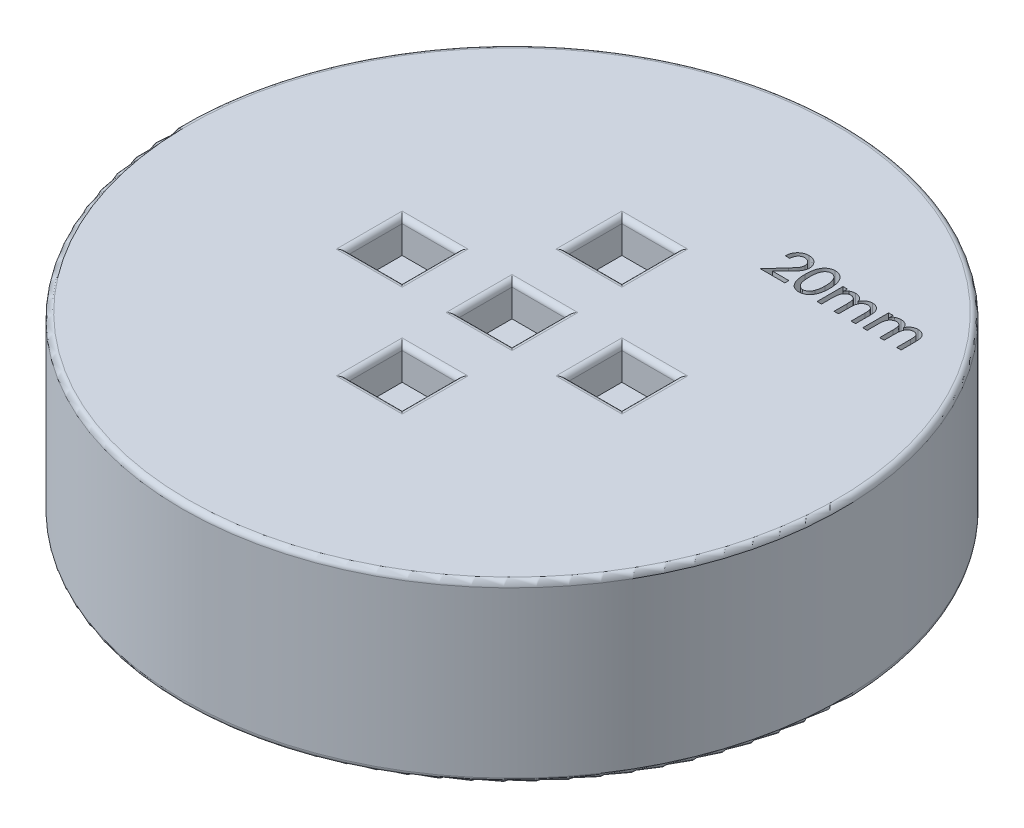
from build123d import *

# Parameters (mm, degrees)
SKETCH1_R           = 30
BOSS_EXTRUDE1_DEPTH = 16
SKETCH2_W           = 5
SKETCH2_H           = 5
CUT_EXTRUDE1_DEPTH  = 3
FILLET1_R           = 0.5
SKETCH4_W           = 5
SKETCH4_H           = 5
CUT_EXTRUDE2_DEPTH  = 3
FILLET2_R           = 0.5
FILLET3_R           = 0.5
CUT_EXTRUDE3_DEPTH  = 2


with BuildPart() as part:
    # Sketch1 → Boss-Extrude1 (new body)
    with BuildSketch(Plane(origin=(0, 0, 0), x_dir=(1, 0, 0), z_dir=(0, 1, 0))):
        with Locations(Location((0, 0, 0), (0, 0, 270))):
            Circle(SKETCH1_R)
    extrude(amount=BOSS_EXTRUDE1_DEPTH)

    # Sketch2 → Cut-Extrude1 (cut)
    with BuildSketch(Plane(origin=(0, 16, 0), x_dir=(1, 0, 0), z_dir=(0, 1, 0))):
        with Locations((0, -10)):
            Rectangle(SKETCH2_W, SKETCH2_H)
        with Locations((-10, 0)):
            Rectangle(SKETCH2_W, SKETCH2_H)
        Rectangle(SKETCH2_W, SKETCH2_H)
        with Locations((0, 10)):
            Rectangle(SKETCH2_W, SKETCH2_H)
        with Locations((10, 0)):
            Rectangle(SKETCH2_W, SKETCH2_H)
    extrude(amount=-CUT_EXTRUDE1_DEPTH, mode=Mode.SUBTRACT)

    # Fillet1
    fillet1_edges = [part.edges().sort_by_distance(p)[0] for p in [
        (2.5, 16, 0),
        (0, 16, 2.5),
        (-12.5, 16, 0),
        (-10, 16, 2.5),
        (-7.5, 16, 0),
        (-10, 16, -2.5),
    ]]
    fillet(fillet1_edges, radius=FILLET1_R)

    # Sketch4 → Cut-Extrude2 (cut)
    with BuildSketch(Plane(origin=(0, 0, 0), x_dir=(-1, 0, 0), z_dir=(0, -1, 0))):
        Rectangle(SKETCH4_W, SKETCH4_H)
        with Locations((0, -10)):
            Rectangle(SKETCH4_W, SKETCH4_H)
        with Locations((10, 0)):
            Rectangle(SKETCH4_W, SKETCH4_H)
        with Locations((-10, 0)):
            Rectangle(SKETCH4_W, SKETCH4_H)
        with Locations((0, 10)):
            Rectangle(SKETCH4_W, SKETCH4_H)
    extrude(amount=-CUT_EXTRUDE2_DEPTH, mode=Mode.SUBTRACT)

    # Fillet2
    fillet2_edges = [part.edges().sort_by_distance(p)[0] for p in [
        (-2.5, 0, 0),
        (0, 0, -2.5),
        (2.5, 0, 0),
        (0, 0, 2.5),
        (-2.5, 0, 10),
        (0, 0, 7.5),
        (2.5, 0, 10),
        (0, 0, 12.5),
        (-12.5, 0, 0),
        (-10, 0, -2.5),
        (-7.5, 0, 0),
        (-10, 0, 2.5),
        (7.5, 0, 0),
        (10, 0, -2.5),
        (12.5, 0, 0),
        (10, 0, 2.5),
        (2.5, 0, -10),
        (0, 0, -7.5),
        (-2.5, 0, -10),
        (0, 0, -12.5),
        (0, 0, -30),
    ]]
    fillet(fillet2_edges, radius=FILLET2_R)

    # Fillet3
    fillet3_edges = [part.edges().sort_by_distance(p)[0] for p in [
        (0, 16, -30),
        (0, 16, 7.5),
        (-2.5, 16, 10),
        (0, 16, 12.5),
        (2.5, 16, 10),
        (-2.5, 16, 0.25),
        (0.25, 16, -2.5),
        (0, 16, -12.5),
        (-2.5, 16, -10),
        (0, 16, -7.5),
        (2.5, 16, -10),
        (10, 16, 2.5),
        (12.5, 16, 0),
        (10, 16, -2.5),
        (7.5, 16, 0),
    ]]
    fillet(fillet3_edges, radius=FILLET3_R)

    # Sketch5 → Cut-Extrude3 (cut)
    # profile 1 of 4: a face of its own
    with BuildSketch(Plane(origin=(0, 16, 0), x_dir=(1, 0, 0), z_dir=(0, 1, 0))):
        with BuildLine():
            Line((8.369706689, 16.912131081), (7.967107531, 16.912131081))
            add(Edge.make_bspline(
                [(7.967107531, 16.912131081), (7.96899866, 16.953097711), (7.97269745, 17.033222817), (7.989121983, 17.149974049), (8.015728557, 17.259983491), (8.04931167, 17.36418373), (8.094110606, 17.461272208), (8.145799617, 17.552941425), (8.20820013, 17.637270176), (8.278716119, 17.71439186), (8.355263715, 17.784459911), (8.43755274, 17.844878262), (8.524192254, 17.896363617), (8.615199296, 17.938376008), (8.710752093, 17.970905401), (8.810578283, 17.994576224), (8.914996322, 18.008813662), (8.986175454, 18.01037699), (9.022260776, 18.011169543)],
                knots=[0, 0, 0, 0, 1.154964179, 2.258951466, 3.315045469, 4.34063582, 5.337653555, 6.322213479, 7.300594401, 8.285733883, 9.262436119, 10.219305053, 11.156568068, 12.097250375, 13.037875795, 13.995471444, 14.983774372, 16, 16, 16, 16], degree=3))
            add(Edge.make_bspline(
                [(9.022260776, 18.011169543), (9.060042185, 18.010396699), (9.134179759, 18.008880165), (9.242141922, 17.994609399), (9.344318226, 17.971597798), (9.44073859, 17.940172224), (9.531227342, 17.898210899), (9.61596292, 17.847610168), (9.694130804, 17.786789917), (9.766298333, 17.718735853), (9.830040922, 17.643875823), (9.887613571, 17.566910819), (9.93520294, 17.486279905), (9.975070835, 17.403455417), (10.005749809, 17.317757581), (10.027415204, 17.229535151), (10.040401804, 17.138728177), (10.042174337, 17.077325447), (10.043069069, 17.046330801)],
                knots=[0, 0, 0, 0, 1.156722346, 2.269809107, 3.328396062, 4.361258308, 5.3694338, 6.377253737, 7.377324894, 8.397019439, 9.4098266, 10.385180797, 11.337325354, 12.27255833, 13.196816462, 14.119704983, 15.050871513, 16, 16, 16, 16], degree=3))
            add(Edge.make_bspline(
                [(10.043069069, 17.046330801), (10.041440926, 17.002974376), (10.038206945, 16.916855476), (10.013304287, 16.789447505), (9.971440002, 16.666143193), (9.923082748, 16.565741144), (9.874175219, 16.484584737), (9.829293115, 16.417597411), (9.776568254, 16.345163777), (9.714869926, 16.26776871), (9.646651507, 16.183641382), (9.569203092, 16.094952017), (9.484921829, 15.999905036), (9.424813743, 15.935904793), (9.393695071, 15.902771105)],
                knots=[0, 0, 0, 0, 1.155755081, 2.295677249, 3.447123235, 4.6205014, 5.259503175, 5.973005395, 6.77029923, 7.648035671, 8.612336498, 9.658570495, 10.787814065, 12, 12, 12, 12], degree=3))
            Line((9.393695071, 15.902771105), (8.612665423, 15.12110544))
            Line((8.612665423, 15.12110544), (10.083774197, 15.12110544))
            Line((10.083774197, 15.12110544), (10.083774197, 14.754759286))
            Line((10.083774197, 14.754759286), (7.844992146, 14.754759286))
            Line((7.844992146, 14.754759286), (9.059785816, 16.096120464))
            add(Edge.make_bspline(
                [(9.059785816, 16.096120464), (9.088720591, 16.126979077), (9.144246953, 16.18619732), (9.222503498, 16.272883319), (9.293108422, 16.353023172), (9.356438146, 16.426559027), (9.410834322, 16.494479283), (9.457760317, 16.555784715), (9.496684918, 16.610764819), (9.537108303, 16.675480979), (9.57716373, 16.753058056), (9.611238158, 16.847691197), (9.631684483, 16.944332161), (9.634572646, 17.009347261), (9.636017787, 17.041878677)],
                knots=[0, 0, 0, 0, 1.341560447, 2.574479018, 3.703506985, 4.728875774, 5.651874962, 6.462761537, 7.177175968, 7.787249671, 8.88179658, 9.938774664, 10.968630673, 12, 12, 12, 12], degree=3))
            add(Edge.make_bspline(
                [(9.636017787, 17.041878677), (9.635661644, 17.062059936), (9.634956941, 17.101992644), (9.625349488, 17.160469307), (9.611815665, 17.217188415), (9.590883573, 17.271238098), (9.565664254, 17.323681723), (9.534119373, 17.373841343), (9.49623958, 17.421251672), (9.454101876, 17.466979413), (9.407496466, 17.508266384), (9.358270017, 17.545294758), (9.30581716, 17.575366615), (9.251572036, 17.60166498), (9.193848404, 17.620308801), (9.134065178, 17.634190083), (9.07175294, 17.643805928), (9.02929402, 17.644479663), (9.00763237, 17.644823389)],
                knots=[0, 0, 0, 0, 0.999432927, 1.977580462, 2.931018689, 3.885672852, 4.844657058, 5.812871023, 6.815890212, 7.849665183, 8.891901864, 9.898878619, 10.897592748, 11.885014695, 12.882178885, 13.896915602, 14.927050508, 16, 16, 16, 16], degree=3))
            add(Edge.make_bspline(
                [(9.00763237, 17.644823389), (8.98703875, 17.64440101), (8.946525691, 17.643570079), (8.886860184, 17.634996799), (8.829588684, 17.621037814), (8.77451799, 17.601675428), (8.721249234, 17.577787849), (8.671084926, 17.546841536), (8.623205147, 17.510841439), (8.576976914, 17.47043675), (8.53490389, 17.423034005), (8.497272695, 17.369194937), (8.464042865, 17.308860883), (8.435639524, 17.242137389), (8.412100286, 17.168849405), (8.393217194, 17.089086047), (8.378618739, 17.002812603), (8.372732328, 16.942917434), (8.369706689, 16.912131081)],
                knots=[0, 0, 0, 0, 0.911540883, 1.79324023, 2.663162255, 3.518366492, 4.375475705, 5.243419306, 6.122264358, 7.02676621, 7.957780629, 8.921596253, 9.930241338, 11.002848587, 12.128200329, 13.335197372, 14.630280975, 16, 16, 16, 16], degree=3))
        make_face()
    # profile 2 of 4: a face of its own
    with BuildSketch(Plane(origin=(0, 16, 0), x_dir=(1, 0, 0), z_dir=(0, 1, 0))):
        with BuildLine():
            add(Edge.make_bspline(
                [(10.328004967, 16.340987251), (10.328308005, 16.391450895), (10.328896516, 16.489453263), (10.33523799, 16.632021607), (10.3461775, 16.765843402), (10.360228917, 16.890922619), (10.37966868, 17.007345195), (10.401911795, 17.115168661), (10.429292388, 17.214406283), (10.461273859, 17.30523514), (10.49718262, 17.389268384), (10.536664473, 17.467558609), (10.57946936, 17.541099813), (10.625308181, 17.60986638), (10.676348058, 17.67232629), (10.729592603, 17.730618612), (10.787041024, 17.783605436), (10.848166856, 17.831021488), (10.911398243, 17.873890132), (10.977482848, 17.910022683), (11.044889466, 17.941497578), (11.114477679, 17.966958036), (11.185742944, 17.986735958), (11.258940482, 18.000547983), (11.333722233, 18.010059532), (11.38440043, 18.010798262), (11.409870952, 18.011169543)],
                knots=[0, 0, 0, 0, 1.622528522, 3.151013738, 4.587225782, 5.939257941, 7.196658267, 8.381214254, 9.47772444, 10.503964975, 11.475138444, 12.414102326, 13.321377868, 14.209997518, 15.068075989, 15.912287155, 16.746865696, 17.577313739, 18.397854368, 19.200328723, 19.996378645, 20.787862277, 21.580050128, 22.371504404, 23.181529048, 24, 24, 24, 24], degree=3))
            add(Edge.make_bspline(
                [(11.409870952, 18.011169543), (11.43765651, 18.010437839), (11.492500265, 18.008993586), (11.573891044, 18.001133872), (11.652552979, 17.985254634), (11.72956535, 17.965341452), (11.803680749, 17.938119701), (11.876367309, 17.906815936), (11.94538778, 17.867166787), (12.013096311, 17.823796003), (12.077171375, 17.773780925), (12.138456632, 17.719436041), (12.195041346, 17.658906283), (12.248988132, 17.594274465), (12.297529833, 17.523009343), (12.343740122, 17.447606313), (12.384656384, 17.366187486), (12.423476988, 17.280193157), (12.456845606, 17.187336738), (12.487047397, 17.088148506), (12.511522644, 16.981392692), (12.531825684, 16.867401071), (12.547472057, 16.745981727), (12.559027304, 16.61742308), (12.565060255, 16.481604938), (12.56620119, 16.388693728), (12.566787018, 16.340987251)],
                knots=[0, 0, 0, 0, 0.875057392, 1.727207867, 2.570264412, 3.399251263, 4.229017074, 5.053828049, 5.887584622, 6.731829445, 7.583639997, 8.443960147, 9.308026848, 10.190032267, 11.091770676, 12.020167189, 12.972467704, 13.958579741, 14.989078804, 16.076606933, 17.221320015, 18.435081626, 19.720875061, 21.074561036, 22.497895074, 24, 24, 24, 24], degree=3))
            add(Edge.make_bspline(
                [(12.566787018, 16.340987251), (12.566195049, 16.293493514), (12.565042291, 16.201007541), (12.559095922, 16.065814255), (12.547241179, 15.937954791), (12.532644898, 15.817070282), (12.512171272, 15.703527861), (12.487242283, 15.597267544), (12.459286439, 15.497730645), (12.425111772, 15.405789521), (12.387270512, 15.319896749), (12.346215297, 15.239205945), (12.300999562, 15.163558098), (12.250934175, 15.093773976), (12.198404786, 15.027657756), (12.141129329, 14.967507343), (12.080151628, 14.912176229), (12.015619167, 14.862369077), (11.948270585, 14.817453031), (11.87768339, 14.77953846), (11.805636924, 14.745885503), (11.73052258, 14.720381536), (11.653863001, 14.698615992), (11.574367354, 14.684556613), (11.492773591, 14.675248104), (11.437670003, 14.673985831), (11.409870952, 14.67334903)],
                knots=[0, 0, 0, 0, 1.496607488, 2.914388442, 4.262485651, 5.541812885, 6.749953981, 7.895567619, 8.980172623, 10.005210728, 10.983286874, 11.936336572, 12.856292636, 13.757107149, 14.640766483, 15.514956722, 16.370989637, 17.232841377, 18.081413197, 18.918442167, 19.755471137, 20.583656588, 21.41504191, 22.264086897, 23.124254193, 24, 24, 24, 24], degree=3))
            add(Edge.make_bspline(
                [(11.409870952, 14.67334903), (11.384196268, 14.673785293), (11.333345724, 14.674649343), (11.258256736, 14.683123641), (11.185109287, 14.697188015), (11.114118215, 14.716899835), (11.044784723, 14.741926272), (10.977409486, 14.772242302), (10.912435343, 14.808951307), (10.849242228, 14.850196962), (10.788747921, 14.897110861), (10.732401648, 14.95013531), (10.678848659, 15.0080031), (10.629149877, 15.071338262), (10.582207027, 15.13973194), (10.539888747, 15.21382849), (10.500434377, 15.292836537), (10.463855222, 15.377364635), (10.430827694, 15.468881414), (10.404485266, 15.56917732), (10.379644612, 15.677157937), (10.361415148, 15.793915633), (10.345598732, 15.918569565), (10.336422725, 16.051928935), (10.32858112, 16.193551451), (10.328200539, 16.290940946), (10.328004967, 16.340987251)],
                knots=[0, 0, 0, 0, 0.82614074, 1.636230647, 2.42850654, 3.22151677, 4.005075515, 4.799112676, 5.596456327, 6.404618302, 7.226350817, 8.05679228, 8.892237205, 9.761873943, 10.645770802, 11.559890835, 12.505927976, 13.487073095, 14.523090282, 15.633895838, 16.822583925, 18.088023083, 19.435493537, 20.865857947, 22.389433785, 24, 24, 24, 24], degree=3))
        make_face()
        with BuildLine():
            add(Edge.make_bspline(
                [(10.735056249, 16.342259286), (10.735219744, 16.299641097), (10.735536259, 16.21713547), (10.740236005, 16.097746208), (10.746927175, 15.98657616), (10.756936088, 15.883655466), (10.770282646, 15.78883109), (10.78607962, 15.702233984), (10.804090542, 15.623698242), (10.826048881, 15.553094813), (10.850362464, 15.488764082), (10.877396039, 15.429539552), (10.905465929, 15.374079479), (10.937085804, 15.323483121), (10.970572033, 15.277059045), (11.006529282, 15.234983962), (11.043673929, 15.196335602), (11.096661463, 15.153420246), (11.164554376, 15.108552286), (11.248835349, 15.069645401), (11.333751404, 15.043963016), (11.391040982, 15.041108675), (11.419411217, 15.039695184)],
                knots=[0, 0, 0, 0, 1.564601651, 3.028951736, 4.386019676, 5.653114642, 6.824348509, 7.900668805, 8.88431448, 9.780488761, 10.613163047, 11.407444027, 12.169849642, 12.89344098, 13.595615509, 14.26934431, 14.924332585, 15.560171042, 16.769153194, 17.901006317, 18.960562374, 20, 20, 20, 20], degree=3))
            add(Edge.make_bspline(
                [(11.419411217, 15.039695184), (11.451560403, 15.041377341), (11.515658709, 15.044731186), (11.610060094, 15.069151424), (11.700575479, 15.110137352), (11.772295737, 15.156442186), (11.826483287, 15.201479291), (11.86561652, 15.239819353), (11.901686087, 15.282623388), (11.935736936, 15.329239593), (11.966525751, 15.380430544), (11.996213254, 15.435034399), (12.022061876, 15.494361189), (12.037001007, 15.53570277), (12.044616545, 15.556777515)],
                knots=[0, 0, 0, 0, 1.331887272, 2.655486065, 4.012646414, 5.436183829, 6.178803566, 6.930724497, 7.703763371, 8.496530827, 9.320959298, 10.178042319, 11.071218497, 12, 12, 12, 12], degree=3))
            add(Edge.make_bspline(
                [(12.044616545, 15.556777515), (12.053791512, 15.58446674), (12.072495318, 15.640913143), (12.095928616, 15.728796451), (12.115328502, 15.821012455), (12.132032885, 15.917070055), (12.144716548, 16.017453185), (12.153483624, 16.122065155), (12.158512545, 16.230906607), (12.159323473, 16.304729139), (12.159735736, 16.342259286)],
                knots=[0, 0, 0, 0, 0.877617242, 1.789083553, 2.735016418, 3.71249782, 4.722174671, 5.778575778, 6.870664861, 8, 8, 8, 8], degree=3))
            add(Edge.make_bspline(
                [(12.159735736, 16.342259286), (12.159637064, 16.379793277), (12.159444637, 16.452990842), (12.153725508, 16.560060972), (12.146808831, 16.661977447), (12.134876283, 16.758405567), (12.121521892, 16.849826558), (12.103204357, 16.935594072), (12.08355775, 17.016564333), (12.059013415, 17.091737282), (12.032179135, 17.161871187), (12.003876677, 17.227199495), (11.973274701, 17.287774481), (11.939558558, 17.342836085), (11.903972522, 17.393292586), (11.866383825, 17.438840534), (11.826232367, 17.479223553), (11.770099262, 17.524756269), (11.697736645, 17.57214595), (11.607253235, 17.614675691), (11.513820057, 17.639748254), (11.450716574, 17.643140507), (11.419411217, 17.644823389)],
                knots=[0, 0, 0, 0, 1.353201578, 2.638969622, 3.865559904, 5.035676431, 6.141732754, 7.195734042, 8.19695873, 9.144657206, 10.044788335, 10.904062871, 11.710933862, 12.489720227, 13.229995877, 13.935715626, 14.616825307, 15.279494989, 16.538995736, 17.725922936, 18.871840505, 20, 20, 20, 20], degree=3))
            add(Edge.make_bspline(
                [(11.419411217, 17.644823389), (11.391049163, 17.643382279), (11.333571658, 17.640461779), (11.248526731, 17.615136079), (11.16454916, 17.575920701), (11.097111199, 17.531021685), (11.044561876, 17.488151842), (11.006910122, 17.450382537), (10.972124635, 17.408069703), (10.938555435, 17.36201931), (10.907903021, 17.311090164), (10.878131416, 17.256211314), (10.851900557, 17.196476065), (10.827231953, 17.132096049), (10.805504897, 17.061363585), (10.786715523, 16.982947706), (10.769924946, 16.896446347), (10.757824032, 16.801430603), (10.747651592, 16.698353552), (10.740038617, 16.587009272), (10.735593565, 16.467379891), (10.735239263, 16.384876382), (10.735056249, 16.342259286)],
                knots=[0, 0, 0, 0, 1.039778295, 2.107176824, 3.232337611, 4.43520669, 5.071253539, 5.720927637, 6.389866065, 7.081397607, 7.811854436, 8.571243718, 9.372887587, 10.205834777, 11.102302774, 12.088086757, 13.166194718, 14.33675119, 15.604261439, 16.970055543, 18.43488556, 20, 20, 20, 20], degree=3))
        make_face(mode=Mode.SUBTRACT)
    # profile 3 of 4: a face of its own
    with BuildSketch(Plane(origin=(0, 16, 0), x_dir=(1, 0, 0), z_dir=(0, 1, 0))):
        with BuildLine():
            Line((13.014543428, 17.115656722), (13.42159471, 17.115656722))
            Line((13.42159471, 17.115656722), (13.42159471, 16.71941774))
            add(Edge.make_bspline(
                [(13.42159471, 16.71941774), (13.425504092, 16.736468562), (13.433131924, 16.76973745), (13.449928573, 16.817213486), (13.470448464, 16.861114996), (13.493803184, 16.902490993), (13.522182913, 16.939736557), (13.553226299, 16.974736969), (13.589166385, 17.005146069), (13.615204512, 17.022815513), (13.628300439, 17.031702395)],
                knots=[0, 0, 0, 0, 1.08898891, 2.124791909, 3.129224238, 4.105481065, 5.077441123, 6.040388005, 7.014409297, 8, 8, 8, 8], degree=3))
            add(Edge.make_bspline(
                [(13.628300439, 17.031702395), (13.66771905, 17.051012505), (13.745549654, 17.089139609), (13.868646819, 17.127012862), (13.993186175, 17.152246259), (14.07720479, 17.154987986), (14.119306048, 17.15636185)],
                knots=[0, 0, 0, 0, 1.028471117, 2.030678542, 3.013184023, 4, 4, 4, 4], degree=3))
            add(Edge.make_bspline(
                [(14.119306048, 17.15636185), (14.150313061, 17.155572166), (14.211802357, 17.154006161), (14.302848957, 17.139406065), (14.3912745, 17.115937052), (14.476245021, 17.083546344), (14.555513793, 17.04380328), (14.627887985, 16.998895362), (14.691594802, 16.947985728), (14.747453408, 16.892243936), (14.793868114, 16.829749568), (14.830469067, 16.761317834), (14.856434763, 16.686095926), (14.865270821, 16.633306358), (14.86980685, 16.606206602)],
                knots=[0, 0, 0, 0, 1.099015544, 2.179432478, 3.260947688, 4.338981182, 5.398181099, 6.40160478, 7.353922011, 8.284349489, 9.192639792, 10.104191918, 11.026778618, 12, 12, 12, 12], degree=3))
            add(Edge.make_bspline(
                [(14.86980685, 16.606206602), (14.877153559, 16.6270907), (14.891680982, 16.668387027), (14.918246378, 16.727881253), (14.950426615, 16.783411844), (14.986818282, 16.835720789), (15.027429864, 16.885130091), (15.07370963, 16.929919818), (15.123286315, 16.972589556), (15.177957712, 17.009993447), (15.234825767, 17.044305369), (15.293503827, 17.074217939), (15.35310817, 17.099853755), (15.414119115, 17.119997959), (15.475753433, 17.136952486), (15.538963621, 17.148356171), (15.603222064, 17.154565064), (15.646372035, 17.155761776), (15.668008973, 17.15636185)],
                knots=[0, 0, 0, 0, 1.024672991, 2.026193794, 3.01103273, 3.991165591, 4.973850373, 5.96628909, 6.969107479, 7.9982829, 9.028393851, 10.042340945, 11.044967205, 12.028827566, 13.014448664, 14.002022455, 14.998142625, 16, 16, 16, 16], degree=3))
            add(Edge.make_bspline(
                [(15.668008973, 17.15636185), (15.690075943, 17.156072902), (15.733458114, 17.15550485), (15.797376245, 17.148705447), (15.859285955, 17.138795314), (15.919093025, 17.124237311), (15.976580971, 17.104900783), (16.032025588, 17.081930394), (16.085700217, 17.055462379), (16.15280677, 17.013712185), (16.231034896, 16.955453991), (16.310409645, 16.871343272), (16.37693451, 16.777624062), (16.420157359, 16.690294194), (16.447695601, 16.613657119), (16.466198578, 16.549328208), (16.481068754, 16.478476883), (16.493938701, 16.401486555), (16.503165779, 16.317807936), (16.509995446, 16.227865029), (16.514705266, 16.13136283), (16.515021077, 16.064961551), (16.515184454, 16.030610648)],
                knots=[0, 0, 0, 0, 0.823429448, 1.618806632, 2.396867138, 3.162757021, 3.913573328, 4.658737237, 5.40200746, 6.144476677, 7.607081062, 9.028926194, 10.443018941, 11.88355177, 12.649646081, 13.481287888, 14.380074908, 15.350698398, 16.394246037, 17.521443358, 18.717785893, 20, 20, 20, 20], degree=3))
            Line((16.515184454, 16.030610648), (16.515184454, 14.754759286))
            Line((16.515184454, 14.754759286), (16.108133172, 14.754759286))
            Line((16.108133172, 14.754759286), (16.108133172, 16.029338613))
            add(Edge.make_bspline(
                [(16.108133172, 16.029338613), (16.108082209, 16.057749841), (16.107984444, 16.112253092), (16.105297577, 16.190286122), (16.101523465, 16.261111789), (16.096764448, 16.324796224), (16.089731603, 16.381432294), (16.081524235, 16.431088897), (16.072572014, 16.473811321), (16.057150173, 16.52051535), (16.033054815, 16.571566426), (15.995414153, 16.62609022), (15.949148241, 16.674083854), (15.8948498, 16.715319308), (15.833917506, 16.749529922), (15.765964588, 16.77260285), (15.692874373, 16.788046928), (15.642017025, 16.789346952), (15.615855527, 16.790015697)],
                knots=[0, 0, 0, 0, 1.305376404, 2.504195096, 3.587062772, 4.564309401, 5.437885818, 6.208191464, 6.877018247, 7.440755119, 8.464755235, 9.459136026, 10.471907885, 11.51427718, 12.582498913, 13.666986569, 14.799875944, 16, 16, 16, 16], degree=3))
            add(Edge.make_bspline(
                [(15.615855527, 16.790015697), (15.58670566, 16.7885944), (15.528336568, 16.785748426), (15.442132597, 16.764914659), (15.35937561, 16.728899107), (15.279940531, 16.680882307), (15.207014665, 16.619817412), (15.142421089, 16.547233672), (15.089128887, 16.462371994), (15.051494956, 16.383496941), (15.02719936, 16.311376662), (15.011858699, 16.247436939), (14.997546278, 16.174954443), (14.987513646, 16.09328814), (14.978107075, 16.00279443), (14.97317161, 15.903233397), (14.968953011, 15.794684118), (14.968582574, 15.719391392), (14.968389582, 15.680164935)],
                knots=[0, 0, 0, 0, 0.96585306, 1.934004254, 2.919496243, 3.947541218, 5.000269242, 6.060662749, 7.154254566, 8.311133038, 8.948925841, 9.673294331, 10.489200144, 11.396606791, 12.399336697, 13.504450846, 14.699853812, 16, 16, 16, 16], degree=3))
            Line((14.968389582, 15.680164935), (14.968389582, 14.754759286))
            Line((14.968389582, 14.754759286), (14.5613383, 14.754759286))
            Line((14.5613383, 14.754759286), (14.5613383, 15.95238048))
            add(Edge.make_bspline(
                [(14.5613383, 15.95238048), (14.56128866, 15.984395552), (14.561193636, 16.045681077), (14.558499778, 16.133464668), (14.554712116, 16.213191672), (14.550021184, 16.284716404), (14.542987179, 16.347927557), (14.534704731, 16.402865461), (14.525885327, 16.449836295), (14.510491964, 16.500449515), (14.486959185, 16.555915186), (14.449176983, 16.614683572), (14.402612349, 16.666512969), (14.347665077, 16.710232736), (14.286084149, 16.746039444), (14.218214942, 16.771669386), (14.144823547, 16.78732558), (14.093945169, 16.789102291), (14.06778862, 16.790015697)],
                knots=[0, 0, 0, 0, 1.376972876, 2.63589934, 3.777064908, 4.810071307, 5.718390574, 6.511518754, 7.200035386, 7.771255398, 8.78422519, 9.780850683, 10.762300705, 11.767731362, 12.789080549, 13.813681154, 14.876014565, 16, 16, 16, 16], degree=3))
            add(Edge.make_bspline(
                [(14.06778862, 16.790015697), (14.039911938, 16.788545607), (13.983901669, 16.78559188), (13.900814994, 16.765267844), (13.81978901, 16.7304831), (13.740978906, 16.683906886), (13.667016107, 16.625074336), (13.602001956, 16.553196), (13.54663048, 16.46971507), (13.508342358, 16.391306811), (13.483168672, 16.320906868), (13.467087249, 16.260169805), (13.452164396, 16.192795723), (13.441178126, 16.118160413), (13.43229295, 16.036691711), (13.426103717, 15.948218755), (13.422256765, 15.852772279), (13.421820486, 15.786807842), (13.42159471, 15.752670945)],
                knots=[0, 0, 0, 0, 0.973948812, 1.956873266, 2.969584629, 4.045778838, 5.147278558, 6.259119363, 7.418022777, 8.637370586, 9.298195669, 10.027900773, 10.831491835, 11.708502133, 12.662464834, 13.694928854, 14.807115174, 16, 16, 16, 16], degree=3))
            Line((13.42159471, 15.752670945), (13.42159471, 14.754759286))
            Line((13.42159471, 14.754759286), (13.014543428, 14.754759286))
            Line((13.014543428, 14.754759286), (13.014543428, 17.115656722))
        make_face()
    # profile 4 of 4: a face of its own
    with BuildSketch(Plane(origin=(0, 16, 0), x_dir=(1, 0, 0), z_dir=(0, 1, 0))):
        with BuildLine():
            Line((17.166466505, 17.115656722), (17.573517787, 17.115656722))
            Line((17.573517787, 17.115656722), (17.573517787, 16.71941774))
            add(Edge.make_bspline(
                [(17.573517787, 16.71941774), (17.577427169, 16.736468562), (17.585055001, 16.76973745), (17.601851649, 16.817213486), (17.622371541, 16.861114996), (17.645726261, 16.902490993), (17.67410599, 16.939736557), (17.705149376, 16.974736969), (17.741089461, 17.005146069), (17.767127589, 17.022815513), (17.780223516, 17.031702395)],
                knots=[0, 0, 0, 0, 1.08898891, 2.124791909, 3.129224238, 4.105481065, 5.077441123, 6.040388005, 7.014409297, 8, 8, 8, 8], degree=3))
            add(Edge.make_bspline(
                [(17.780223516, 17.031702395), (17.819642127, 17.051012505), (17.897472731, 17.089139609), (18.020569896, 17.127012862), (18.145109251, 17.152246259), (18.229127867, 17.154987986), (18.271229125, 17.15636185)],
                knots=[0, 0, 0, 0, 1.028471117, 2.030678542, 3.013184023, 4, 4, 4, 4], degree=3))
            add(Edge.make_bspline(
                [(18.271229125, 17.15636185), (18.302236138, 17.155572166), (18.363725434, 17.154006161), (18.454772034, 17.139406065), (18.543197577, 17.115937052), (18.628168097, 17.083546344), (18.70743687, 17.04380328), (18.779811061, 16.998895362), (18.843517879, 16.947985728), (18.899376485, 16.892243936), (18.945791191, 16.829749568), (18.982392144, 16.761317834), (19.00835784, 16.686095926), (19.017193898, 16.633306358), (19.021729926, 16.606206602)],
                knots=[0, 0, 0, 0, 1.099015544, 2.179432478, 3.260947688, 4.338981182, 5.398181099, 6.40160478, 7.353922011, 8.284349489, 9.192639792, 10.104191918, 11.026778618, 12, 12, 12, 12], degree=3))
            add(Edge.make_bspline(
                [(19.021729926, 16.606206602), (19.029076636, 16.6270907), (19.043604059, 16.668387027), (19.070169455, 16.727881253), (19.102349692, 16.783411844), (19.138741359, 16.835720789), (19.179352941, 16.885130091), (19.225632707, 16.929919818), (19.275209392, 16.972589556), (19.329880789, 17.009993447), (19.386748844, 17.044305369), (19.445426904, 17.074217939), (19.505031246, 17.099853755), (19.566042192, 17.119997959), (19.62767651, 17.136952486), (19.690886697, 17.148356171), (19.755145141, 17.154565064), (19.798295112, 17.155761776), (19.81993205, 17.15636185)],
                knots=[0, 0, 0, 0, 1.024672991, 2.026193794, 3.01103273, 3.991165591, 4.973850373, 5.96628909, 6.969107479, 7.9982829, 9.028393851, 10.042340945, 11.044967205, 12.028827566, 13.014448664, 14.002022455, 14.998142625, 16, 16, 16, 16], degree=3))
            add(Edge.make_bspline(
                [(19.81993205, 17.15636185), (19.84199902, 17.156072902), (19.885381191, 17.15550485), (19.949299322, 17.148705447), (20.011209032, 17.138795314), (20.071016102, 17.124237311), (20.128504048, 17.104900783), (20.183948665, 17.081930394), (20.237623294, 17.055462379), (20.304729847, 17.013712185), (20.382957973, 16.955453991), (20.462332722, 16.871343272), (20.528857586, 16.777624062), (20.572080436, 16.690294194), (20.599618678, 16.613657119), (20.618121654, 16.549328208), (20.632991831, 16.478476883), (20.645861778, 16.401486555), (20.655088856, 16.317807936), (20.661918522, 16.227865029), (20.666628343, 16.13136283), (20.666944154, 16.064961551), (20.667107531, 16.030610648)],
                knots=[0, 0, 0, 0, 0.823429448, 1.618806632, 2.396867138, 3.162757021, 3.913573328, 4.658737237, 5.40200746, 6.144476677, 7.607081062, 9.028926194, 10.443018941, 11.88355177, 12.649646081, 13.481287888, 14.380074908, 15.350698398, 16.394246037, 17.521443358, 18.717785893, 20, 20, 20, 20], degree=3))
            Line((20.667107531, 16.030610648), (20.667107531, 14.754759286))
            Line((20.667107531, 14.754759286), (20.260056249, 14.754759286))
            Line((20.260056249, 14.754759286), (20.260056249, 16.029338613))
            add(Edge.make_bspline(
                [(20.260056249, 16.029338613), (20.260005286, 16.057749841), (20.259907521, 16.112253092), (20.257220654, 16.190286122), (20.253446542, 16.261111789), (20.248687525, 16.324796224), (20.24165468, 16.381432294), (20.233447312, 16.431088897), (20.224495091, 16.473811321), (20.20907325, 16.52051535), (20.184977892, 16.571566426), (20.147337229, 16.62609022), (20.101071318, 16.674083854), (20.046772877, 16.715319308), (19.985840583, 16.749529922), (19.917887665, 16.77260285), (19.84479745, 16.788046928), (19.793940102, 16.789346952), (19.767778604, 16.790015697)],
                knots=[0, 0, 0, 0, 1.305376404, 2.504195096, 3.587062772, 4.564309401, 5.437885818, 6.208191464, 6.877018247, 7.440755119, 8.464755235, 9.459136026, 10.471907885, 11.51427718, 12.582498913, 13.666986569, 14.799875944, 16, 16, 16, 16], degree=3))
            add(Edge.make_bspline(
                [(19.767778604, 16.790015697), (19.738628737, 16.7885944), (19.680259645, 16.785748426), (19.594055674, 16.764914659), (19.511298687, 16.728899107), (19.431863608, 16.680882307), (19.358937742, 16.619817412), (19.294344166, 16.547233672), (19.241051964, 16.462371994), (19.203418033, 16.383496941), (19.179122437, 16.311376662), (19.163781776, 16.247436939), (19.149469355, 16.174954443), (19.139436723, 16.09328814), (19.130030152, 16.00279443), (19.125094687, 15.903233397), (19.120876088, 15.794684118), (19.120505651, 15.719391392), (19.120312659, 15.680164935)],
                knots=[0, 0, 0, 0, 0.96585306, 1.934004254, 2.919496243, 3.947541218, 5.000269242, 6.060662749, 7.154254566, 8.311133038, 8.948925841, 9.673294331, 10.489200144, 11.396606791, 12.399336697, 13.504450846, 14.699853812, 16, 16, 16, 16], degree=3))
            Line((19.120312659, 15.680164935), (19.120312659, 14.754759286))
            Line((19.120312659, 14.754759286), (18.713261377, 14.754759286))
            Line((18.713261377, 14.754759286), (18.713261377, 15.95238048))
            add(Edge.make_bspline(
                [(18.713261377, 15.95238048), (18.713211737, 15.984395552), (18.713116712, 16.045681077), (18.710422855, 16.133464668), (18.706635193, 16.213191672), (18.701944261, 16.284716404), (18.694910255, 16.347927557), (18.686627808, 16.402865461), (18.677808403, 16.449836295), (18.662415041, 16.500449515), (18.638882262, 16.555915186), (18.60110006, 16.614683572), (18.554535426, 16.666512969), (18.499588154, 16.710232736), (18.438007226, 16.746039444), (18.370138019, 16.771669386), (18.296746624, 16.78732558), (18.245868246, 16.789102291), (18.219711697, 16.790015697)],
                knots=[0, 0, 0, 0, 1.376972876, 2.63589934, 3.777064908, 4.810071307, 5.718390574, 6.511518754, 7.200035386, 7.771255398, 8.78422519, 9.780850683, 10.762300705, 11.767731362, 12.789080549, 13.813681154, 14.876014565, 16, 16, 16, 16], degree=3))
            add(Edge.make_bspline(
                [(18.219711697, 16.790015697), (18.191835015, 16.788545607), (18.135824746, 16.78559188), (18.052738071, 16.765267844), (17.971712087, 16.7304831), (17.892901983, 16.683906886), (17.818939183, 16.625074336), (17.753925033, 16.553196), (17.698553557, 16.46971507), (17.660265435, 16.391306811), (17.635091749, 16.320906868), (17.619010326, 16.260169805), (17.604087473, 16.192795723), (17.593101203, 16.118160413), (17.584216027, 16.036691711), (17.578026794, 15.948218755), (17.574179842, 15.852772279), (17.573743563, 15.786807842), (17.573517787, 15.752670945)],
                knots=[0, 0, 0, 0, 0.973948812, 1.956873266, 2.969584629, 4.045778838, 5.147278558, 6.259119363, 7.418022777, 8.637370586, 9.298195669, 10.027900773, 10.831491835, 11.708502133, 12.662464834, 13.694928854, 14.807115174, 16, 16, 16, 16], degree=3))
            Line((17.573517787, 15.752670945), (17.573517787, 14.754759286))
            Line((17.573517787, 14.754759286), (17.166466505, 14.754759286))
            Line((17.166466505, 14.754759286), (17.166466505, 17.115656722))
        make_face()
    extrude(amount=-CUT_EXTRUDE3_DEPTH, mode=Mode.SUBTRACT)


solid = part.part
